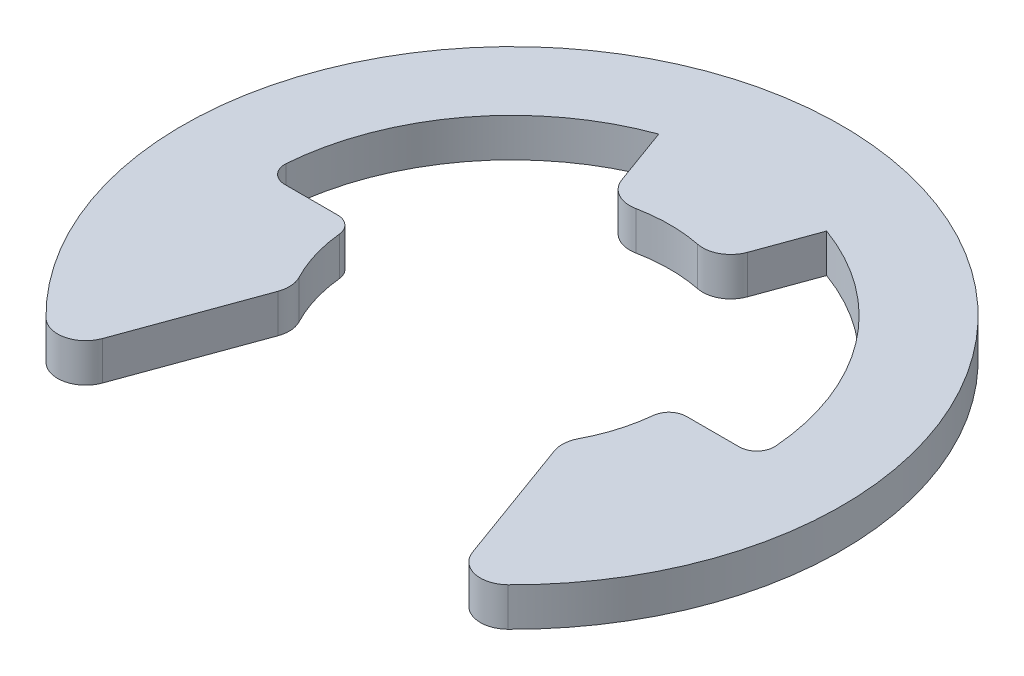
from build123d import *

# Parameters (mm, degrees)
BOSS_EXTRUDE1_DEPTH = 0.55
FILLET1_R           = 0.8
FILLET2_R           = 0.5


with BuildPart() as part:
    # Sketch2 → Boss-Extrude1 (new, symmetric)
    with BuildSketch(Plane(origin=(0, 0, 0), x_dir=(1, 0, 0), z_dir=(0, 1, 0))):
        with BuildLine():
            Line((-5.674067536, -7.494328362), (-3.815, -2.386582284))
            ThreePointArc((-3.815, -2.386582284), (-4.325361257, -1.241470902), (-4.5, 0))
            Line((-4.5, 0), (-7, 0))
            ThreePointArc((-7, 0), (-5.73406431, 4.015035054), (-2.394141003, 6.577848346))
            Line((-2.394141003, 6.577848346), (-1.539090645, 4.228616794))
            ThreePointArc((-1.539090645, 4.228616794), (0, 4.5), (1.539090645, 4.228616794))
            Line((1.539090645, 4.228616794), (2.394141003, 6.577848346))
            ThreePointArc((2.394141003, 6.577848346), (5.73406431, 4.015035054), (7, 0))
            Line((7, 0), (4.5, 0))
            ThreePointArc((4.5, 0), (4.325361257, -1.241470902), (3.815, -2.386582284))
            Line((3.815, -2.386582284), (5.674067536, -7.494328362))
            ThreePointArc((5.674067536, -7.494328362), (0, 9.4), (-5.674067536, -7.494328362))
        make_face()
    extrude(amount=BOSS_EXTRUDE1_DEPTH, both=True)

    # Fillet1
    fillet1_edges = [part.edges().sort_by_distance(p)[0] for p in [
        (-3.815, 0, 2.386582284),
        (-5.674067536, 0, 7.494328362),
        (5.674067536, 0, 7.494328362),
        (3.815, 0, 2.386582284),
        (1.539090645, 0, -4.228616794),
        (-1.539090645, 0, -4.228616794),
    ]]
    fillet(fillet1_edges, radius=FILLET1_R)

    # Fillet2
    fillet2_edges = [part.edges().sort_by_distance(p)[0] for p in [
        (-7, 0, 0),
        (-4.5, 0, 0),
        (4.5, 0, 0),
        (7, 0, 0),
    ]]
    fillet(fillet2_edges, radius=FILLET2_R)


solid = part.part
